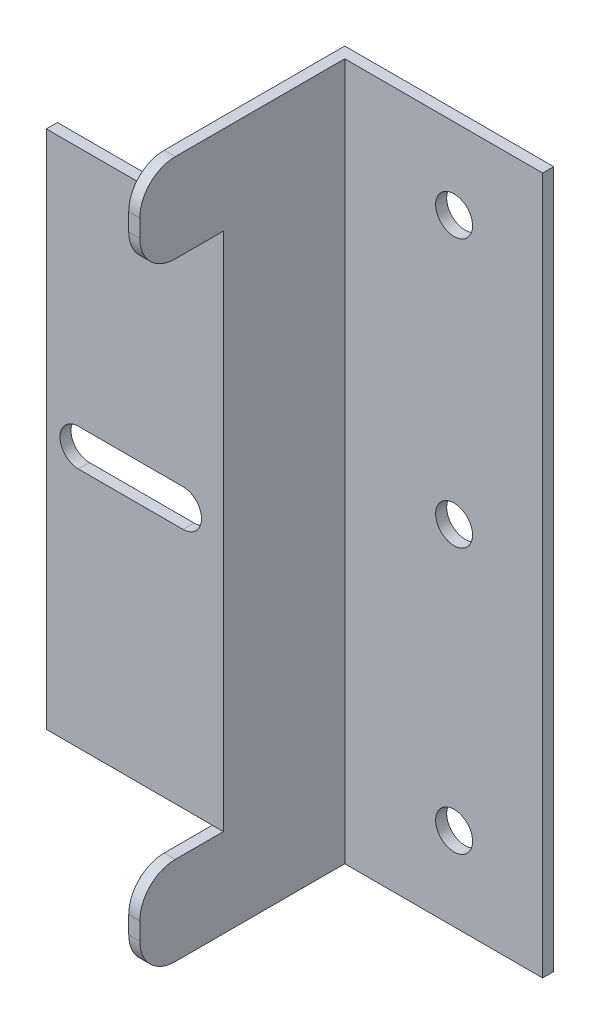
ISO-10303-21;
HEADER;
FILE_DESCRIPTION(('STEP AP214'),'2;1');
FILE_NAME('part.step','',(''),(''),'','','');
FILE_SCHEMA(('AUTOMOTIVE_DESIGN { 1 0 10303 214 1 1 1 1 }'));
ENDSEC;
DATA;
#1=APPLICATION_CONTEXT('core data for automotive mechanical design processes');
#2=APPLICATION_PROTOCOL_DEFINITION('international standard','automotive_design',2000,#1);
#3=PRODUCT_CONTEXT('',#1,'mechanical');
#4=PRODUCT('Part','Part','',(#3));
#5=PRODUCT_RELATED_PRODUCT_CATEGORY('part','',(#4));
#6=PRODUCT_DEFINITION_FORMATION('','',#4);
#7=PRODUCT_DEFINITION_CONTEXT('part definition',#1,'design');
#8=PRODUCT_DEFINITION('design','',#6,#7);
#9=PRODUCT_DEFINITION_SHAPE('','',#8);
#10=(LENGTH_UNIT() NAMED_UNIT(*) SI_UNIT(.MILLI.,.METRE.));
#11=(NAMED_UNIT(*) PLANE_ANGLE_UNIT() SI_UNIT($,.RADIAN.));
#12=(NAMED_UNIT(*) SI_UNIT($,.STERADIAN.) SOLID_ANGLE_UNIT());
#13=UNCERTAINTY_MEASURE_WITH_UNIT(LENGTH_MEASURE(1.E-05),#10,'distance_accuracy_value','');
#14=(GEOMETRIC_REPRESENTATION_CONTEXT(3) GLOBAL_UNCERTAINTY_ASSIGNED_CONTEXT((#13)) GLOBAL_UNIT_ASSIGNED_CONTEXT((#10,
#11,#12)) REPRESENTATION_CONTEXT('',''));
#15=CARTESIAN_POINT('',(0.,0.,0.));
#16=DIRECTION('',(0.,0.,1.));
#17=DIRECTION('',(1.,0.,0.));
#18=AXIS2_PLACEMENT_3D('',#15,#16,#17);
#19=CARTESIAN_POINT('',(1.5875,49.9999,18.9992));
#20=DIRECTION('',(0.,0.,-1.));
#21=DIRECTION('',(-1.,0.,0.));
#22=AXIS2_PLACEMENT_3D('',#19,#20,#21);
#23=PLANE('',#22);
#24=DIRECTION('',(-1.,0.,0.));
#25=VECTOR('',#24,1.);
#26=CARTESIAN_POINT('',(1.5875,-2.65,18.9992));
#27=LINE('',#26,#25);
#28=CARTESIAN_POINT('',(-4.19771789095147,-2.65,18.9992));
#29=VERTEX_POINT('',#28);
#30=CARTESIAN_POINT('',(-19.2018800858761,-2.65,18.9992));
#31=VERTEX_POINT('',#30);
#32=EDGE_CURVE('E189',#29,#31,#27,.T.);
#33=ORIENTED_EDGE('',*,*,#32,.T.);
#34=CARTESIAN_POINT('',(-19.2018800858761,0.,18.9992));
#35=DIRECTION('',(0.,0.,-1.));
#36=DIRECTION('',(-1.,0.,0.));
#37=AXIS2_PLACEMENT_3D('',#34,#35,#36);
#38=CIRCLE('',#37,2.65);
#39=CARTESIAN_POINT('',(-19.2018800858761,2.65,18.9992));
#40=VERTEX_POINT('',#39);
#41=EDGE_CURVE('E211',#31,#40,#38,.T.);
#42=ORIENTED_EDGE('',*,*,#41,.T.);
#43=DIRECTION('',(1.,0.,0.));
#44=VECTOR('',#43,1.);
#45=CARTESIAN_POINT('',(1.5875,2.65,18.9992));
#46=LINE('',#45,#44);
#47=CARTESIAN_POINT('',(-4.19771789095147,2.65,18.9992));
#48=VERTEX_POINT('',#47);
#49=EDGE_CURVE('E210',#40,#48,#46,.T.);
#50=ORIENTED_EDGE('',*,*,#49,.T.);
#51=CARTESIAN_POINT('',(-4.19771789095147,0.,18.9992));
#52=DIRECTION('',(0.,0.,-1.));
#53=DIRECTION('',(-1.,0.,0.));
#54=AXIS2_PLACEMENT_3D('',#51,#52,#53);
#55=CIRCLE('',#54,2.65);
#56=EDGE_CURVE('E191',#48,#29,#55,.T.);
#57=ORIENTED_EDGE('',*,*,#56,.T.);
#58=EDGE_LOOP('',(#33,#42,#50,#57));
#59=FACE_BOUND('',#58,.T.);
#60=DIRECTION('',(1.,0.,0.));
#61=VECTOR('',#60,1.);
#62=CARTESIAN_POINT('',(0.,37.2999,18.9992));
#63=LINE('',#62,#61);
#64=CARTESIAN_POINT('',(0.,37.2999,18.9992));
#65=VERTEX_POINT('',#64);
#66=CARTESIAN_POINT('',(1.5875,37.2999,18.9992));
#67=VERTEX_POINT('',#66);
#68=EDGE_CURVE('E308',#65,#67,#63,.T.);
#69=ORIENTED_EDGE('',*,*,#68,.F.);
#70=DIRECTION('',(-1.,0.,0.));
#71=VECTOR('',#70,1.);
#72=CARTESIAN_POINT('',(12.7988341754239,37.2999,18.9992));
#73=LINE('',#72,#71);
#74=CARTESIAN_POINT('',(-23.8125,37.2999,18.9992));
#75=VERTEX_POINT('',#74);
#76=EDGE_CURVE('E229',#65,#75,#73,.T.);
#77=ORIENTED_EDGE('',*,*,#76,.T.);
#78=DIRECTION('',(0.,-1.,0.));
#79=VECTOR('',#78,1.);
#80=CARTESIAN_POINT('',(-23.8125,49.9999,18.9992));
#81=LINE('',#80,#79);
#82=CARTESIAN_POINT('',(-23.8125,-37.2999,18.9992));
#83=VERTEX_POINT('',#82);
#84=EDGE_CURVE('E384',#75,#83,#81,.T.);
#85=ORIENTED_EDGE('',*,*,#84,.T.);
#86=DIRECTION('',(-1.,0.,0.));
#87=VECTOR('',#86,1.);
#88=CARTESIAN_POINT('',(12.7988341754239,-37.2999,18.9992));
#89=LINE('',#88,#87);
#90=CARTESIAN_POINT('',(0.,-37.2999,18.9992));
#91=VERTEX_POINT('',#90);
#92=EDGE_CURVE('E235',#91,#83,#89,.T.);
#93=ORIENTED_EDGE('',*,*,#92,.F.);
#94=DIRECTION('',(1.,0.,0.));
#95=VECTOR('',#94,1.);
#96=CARTESIAN_POINT('',(0.,-37.2999,18.9992));
#97=LINE('',#96,#95);
#98=CARTESIAN_POINT('',(1.5875,-37.2999,18.9992));
#99=VERTEX_POINT('',#98);
#100=EDGE_CURVE('E265',#91,#99,#97,.T.);
#101=ORIENTED_EDGE('',*,*,#100,.T.);
#102=DIRECTION('',(0.,-1.,0.));
#103=VECTOR('',#102,1.);
#104=CARTESIAN_POINT('',(1.5875,49.9999,18.9992));
#105=LINE('',#104,#103);
#106=EDGE_CURVE('E381',#67,#99,#105,.T.);
#107=ORIENTED_EDGE('',*,*,#106,.F.);
#108=EDGE_LOOP('',(#69,#77,#85,#93,#101,#107));
#109=FACE_BOUND('',#108,.T.);
#110=ADVANCED_FACE('F44',(#59,#109),#23,.F.);
#111=CARTESIAN_POINT('',(29.972,49.9999,1.5875));
#112=DIRECTION('',(-1.,0.,0.));
#113=DIRECTION('',(0.,0.,1.));
#114=AXIS2_PLACEMENT_3D('',#111,#112,#113);
#115=PLANE('',#114);
#116=DIRECTION('',(0.,0.,-1.));
#117=VECTOR('',#116,1.);
#118=CARTESIAN_POINT('',(29.972,-49.9999,1.5875));
#119=LINE('',#118,#117);
#120=CARTESIAN_POINT('',(29.972,-49.9999,1.5875));
#121=VERTEX_POINT('',#120);
#122=CARTESIAN_POINT('',(29.972,-49.9999,0.));
#123=VERTEX_POINT('',#122);
#124=EDGE_CURVE('E285',#121,#123,#119,.T.);
#125=ORIENTED_EDGE('',*,*,#124,.T.);
#126=DIRECTION('',(0.,-1.,0.));
#127=VECTOR('',#126,1.);
#128=CARTESIAN_POINT('',(29.972,49.9999,0.));
#129=LINE('',#128,#127);
#130=CARTESIAN_POINT('',(29.972,49.9999,0.));
#131=VERTEX_POINT('',#130);
#132=EDGE_CURVE('E402',#131,#123,#129,.T.);
#133=ORIENTED_EDGE('',*,*,#132,.F.);
#134=DIRECTION('',(0.,0.,-1.));
#135=VECTOR('',#134,1.);
#136=CARTESIAN_POINT('',(29.972,49.9999,1.5875));
#137=LINE('',#136,#135);
#138=CARTESIAN_POINT('',(29.972,49.9999,1.5875));
#139=VERTEX_POINT('',#138);
#140=EDGE_CURVE('E341',#139,#131,#137,.T.);
#141=ORIENTED_EDGE('',*,*,#140,.F.);
#142=DIRECTION('',(0.,-1.,0.));
#143=VECTOR('',#142,1.);
#144=CARTESIAN_POINT('',(29.972,49.9999,1.5875));
#145=LINE('',#144,#143);
#146=EDGE_CURVE('E358',#139,#121,#145,.T.);
#147=ORIENTED_EDGE('',*,*,#146,.T.);
#148=EDGE_LOOP('',(#125,#133,#141,#147));
#149=FACE_BOUND('',#148,.T.);
#150=ADVANCED_FACE('F50',(#149),#115,.F.);
#151=CARTESIAN_POINT('',(29.972,49.9999,0.));
#152=DIRECTION('',(0.,0.,1.));
#153=DIRECTION('',(1.,0.,0.));
#154=AXIS2_PLACEMENT_3D('',#151,#152,#153);
#155=PLANE('',#154);
#156=CARTESIAN_POINT('',(17.272,0.,0.));
#157=DIRECTION('',(0.,0.,1.));
#158=DIRECTION('',(1.,0.,0.));
#159=AXIS2_PLACEMENT_3D('',#156,#157,#158);
#160=CIRCLE('',#159,2.65);
#161=CARTESIAN_POINT('',(19.922,0.,0.));
#162=VERTEX_POINT('',#161);
#163=EDGE_CURVE('E437',#162,#162,#160,.T.);
#164=ORIENTED_EDGE('',*,*,#163,.T.);
#165=EDGE_LOOP('',(#164));
#166=FACE_BOUND('',#165,.T.);
#167=CARTESIAN_POINT('',(17.272,38.408858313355,0.));
#168=DIRECTION('',(0.,0.,1.));
#169=DIRECTION('',(1.,0.,0.));
#170=AXIS2_PLACEMENT_3D('',#167,#168,#169);
#171=CIRCLE('',#170,2.65);
#172=CARTESIAN_POINT('',(19.922,38.408858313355,0.));
#173=VERTEX_POINT('',#172);
#174=EDGE_CURVE('E445',#173,#173,#171,.T.);
#175=ORIENTED_EDGE('',*,*,#174,.T.);
#176=EDGE_LOOP('',(#175));
#177=FACE_BOUND('',#176,.T.);
#178=CARTESIAN_POINT('',(17.272,-38.0494771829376,0.));
#179=DIRECTION('',(0.,0.,1.));
#180=DIRECTION('',(1.,0.,0.));
#181=AXIS2_PLACEMENT_3D('',#178,#179,#180);
#182=CIRCLE('',#181,2.65);
#183=CARTESIAN_POINT('',(19.922,-38.0494771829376,0.));
#184=VERTEX_POINT('',#183);
#185=EDGE_CURVE('E440',#184,#184,#182,.T.);
#186=ORIENTED_EDGE('',*,*,#185,.T.);
#187=EDGE_LOOP('',(#186));
#188=FACE_BOUND('',#187,.T.);
#189=DIRECTION('',(-1.,0.,0.));
#190=VECTOR('',#189,1.);
#191=CARTESIAN_POINT('',(29.972,-49.9999,0.));
#192=LINE('',#191,#190);
#193=CARTESIAN_POINT('',(0.,-49.9999,0.));
#194=VERTEX_POINT('',#193);
#195=EDGE_CURVE('E361',#123,#194,#192,.T.);
#196=ORIENTED_EDGE('',*,*,#195,.T.);
#197=DIRECTION('',(0.,-1.,0.));
#198=VECTOR('',#197,1.);
#199=CARTESIAN_POINT('',(0.,49.9999,0.));
#200=LINE('',#199,#198);
#201=CARTESIAN_POINT('',(0.,49.9999,0.));
#202=VERTEX_POINT('',#201);
#203=EDGE_CURVE('E396',#202,#194,#200,.T.);
#204=ORIENTED_EDGE('',*,*,#203,.F.);
#205=DIRECTION('',(-1.,0.,0.));
#206=VECTOR('',#205,1.);
#207=CARTESIAN_POINT('',(29.972,49.9999,0.));
#208=LINE('',#207,#206);
#209=EDGE_CURVE('E347',#131,#202,#208,.T.);
#210=ORIENTED_EDGE('',*,*,#209,.F.);
#211=ORIENTED_EDGE('',*,*,#132,.T.);
#212=EDGE_LOOP('',(#196,#204,#210,#211));
#213=FACE_BOUND('',#212,.T.);
#214=ADVANCED_FACE('F448',(#166,#177,#188,#213),#155,.F.);
#215=CARTESIAN_POINT('',(0.,49.9999,0.));
#216=DIRECTION('',(1.,0.,0.));
#217=DIRECTION('',(0.,0.,-1.));
#218=AXIS2_PLACEMENT_3D('',#215,#216,#217);
#219=PLANE('',#218);
#220=DIRECTION('',(0.,0.,1.));
#221=VECTOR('',#220,1.);
#222=CARTESIAN_POINT('',(0.,-49.9999,0.));
#223=LINE('',#222,#221);
#224=CARTESIAN_POINT('',(0.,-49.9999,25.908));
#225=VERTEX_POINT('',#224);
#226=EDGE_CURVE('E368',#194,#225,#223,.T.);
#227=ORIENTED_EDGE('',*,*,#226,.T.);
#228=CARTESIAN_POINT('',(0.,-44.9199,25.908));
#229=DIRECTION('',(1.,0.,0.));
#230=DIRECTION('',(0.,0.,1.));
#231=AXIS2_PLACEMENT_3D('',#228,#229,#230);
#232=CIRCLE('',#231,5.08);
#233=CARTESIAN_POINT('',(0.,-44.9199,30.988));
#234=VERTEX_POINT('',#233);
#235=EDGE_CURVE('E256',#234,#225,#232,.T.);
#236=ORIENTED_EDGE('',*,*,#235,.F.);
#237=DIRECTION('',(0.,-1.,0.));
#238=VECTOR('',#237,1.);
#239=CARTESIAN_POINT('',(0.,-44.9199,30.988));
#240=LINE('',#239,#238);
#241=CARTESIAN_POINT('',(0.,-42.3799,30.988));
#242=VERTEX_POINT('',#241);
#243=EDGE_CURVE('E255',#242,#234,#240,.T.);
#244=ORIENTED_EDGE('',*,*,#243,.F.);
#245=CARTESIAN_POINT('',(0.,-42.3799,25.908));
#246=DIRECTION('',(1.,0.,0.));
#247=DIRECTION('',(0.,0.,1.));
#248=AXIS2_PLACEMENT_3D('',#245,#246,#247);
#249=CIRCLE('',#248,5.08);
#250=CARTESIAN_POINT('',(0.,-37.2999,25.908));
#251=VERTEX_POINT('',#250);
#252=EDGE_CURVE('E248',#251,#242,#249,.T.);
#253=ORIENTED_EDGE('',*,*,#252,.F.);
#254=DIRECTION('',(0.,0.,1.));
#255=VECTOR('',#254,1.);
#256=CARTESIAN_POINT('',(0.,-37.2999,25.908));
#257=LINE('',#256,#255);
#258=EDGE_CURVE('E242',#91,#251,#257,.T.);
#259=ORIENTED_EDGE('',*,*,#258,.F.);
#260=DIRECTION('',(0.,0.,-1.));
#261=VECTOR('',#260,1.);
#262=CARTESIAN_POINT('',(0.,-37.2999,17.4117));
#263=LINE('',#262,#261);
#264=CARTESIAN_POINT('',(0.,-37.2999,17.4117));
#265=VERTEX_POINT('',#264);
#266=EDGE_CURVE('E237',#91,#265,#263,.T.);
#267=ORIENTED_EDGE('',*,*,#266,.T.);
#268=DIRECTION('',(0.,-1.,0.));
#269=VECTOR('',#268,1.);
#270=CARTESIAN_POINT('',(0.,49.9999,17.4117));
#271=LINE('',#270,#269);
#272=CARTESIAN_POINT('',(0.,37.2999,17.4117));
#273=VERTEX_POINT('',#272);
#274=EDGE_CURVE('E395',#273,#265,#271,.T.);
#275=ORIENTED_EDGE('',*,*,#274,.F.);
#276=DIRECTION('',(0.,0.,1.));
#277=VECTOR('',#276,1.);
#278=CARTESIAN_POINT('',(0.,37.2999,17.4117));
#279=LINE('',#278,#277);
#280=EDGE_CURVE('E224',#273,#65,#279,.T.);
#281=ORIENTED_EDGE('',*,*,#280,.T.);
#282=DIRECTION('',(0.,0.,-1.));
#283=VECTOR('',#282,1.);
#284=CARTESIAN_POINT('',(0.,37.2999,25.908));
#285=LINE('',#284,#283);
#286=CARTESIAN_POINT('',(0.,37.2999,25.908));
#287=VERTEX_POINT('',#286);
#288=EDGE_CURVE('E298',#287,#65,#285,.T.);
#289=ORIENTED_EDGE('',*,*,#288,.F.);
#290=CARTESIAN_POINT('',(0.,42.3799,25.908));
#291=DIRECTION('',(1.,0.,0.));
#292=DIRECTION('',(0.,0.,-1.));
#293=AXIS2_PLACEMENT_3D('',#290,#291,#292);
#294=CIRCLE('',#293,5.08);
#295=CARTESIAN_POINT('',(0.,42.3799,30.988));
#296=VERTEX_POINT('',#295);
#297=EDGE_CURVE('E332',#296,#287,#294,.T.);
#298=ORIENTED_EDGE('',*,*,#297,.F.);
#299=DIRECTION('',(0.,-1.,0.));
#300=VECTOR('',#299,1.);
#301=CARTESIAN_POINT('',(0.,44.9199,30.988));
#302=LINE('',#301,#300);
#303=CARTESIAN_POINT('',(0.,44.9199,30.988));
#304=VERTEX_POINT('',#303);
#305=EDGE_CURVE('E333',#304,#296,#302,.T.);
#306=ORIENTED_EDGE('',*,*,#305,.F.);
#307=CARTESIAN_POINT('',(0.,44.9199,25.908));
#308=DIRECTION('',(1.,0.,0.));
#309=DIRECTION('',(0.,0.,-1.));
#310=AXIS2_PLACEMENT_3D('',#307,#308,#309);
#311=CIRCLE('',#310,5.08);
#312=CARTESIAN_POINT('',(0.,49.9999,25.908));
#313=VERTEX_POINT('',#312);
#314=EDGE_CURVE('E320',#313,#304,#311,.T.);
#315=ORIENTED_EDGE('',*,*,#314,.F.);
#316=DIRECTION('',(0.,0.,1.));
#317=VECTOR('',#316,1.);
#318=CARTESIAN_POINT('',(0.,49.9999,0.));
#319=LINE('',#318,#317);
#320=EDGE_CURVE('E348',#202,#313,#319,.T.);
#321=ORIENTED_EDGE('',*,*,#320,.F.);
#322=ORIENTED_EDGE('',*,*,#203,.T.);
#323=EDGE_LOOP('',(#227,#236,#244,#253,#259,#267,#275,#281,#289,#298,#306,#315,#321,#322));
#324=FACE_BOUND('',#323,.T.);
#325=ADVANCED_FACE('F493',(#324),#219,.F.);
#326=CARTESIAN_POINT('',(0.,49.9999,17.4117));
#327=DIRECTION('',(0.,0.,1.));
#328=DIRECTION('',(1.,0.,0.));
#329=AXIS2_PLACEMENT_3D('',#326,#327,#328);
#330=PLANE('',#329);
#331=DIRECTION('',(-1.,0.,0.));
#332=VECTOR('',#331,1.);
#333=CARTESIAN_POINT('',(0.,2.65,17.4117));
#334=LINE('',#333,#332);
#335=CARTESIAN_POINT('',(-4.19771789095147,2.65,17.4117));
#336=VERTEX_POINT('',#335);
#337=CARTESIAN_POINT('',(-19.2018800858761,2.65,17.4117));
#338=VERTEX_POINT('',#337);
#339=EDGE_CURVE('E53',#336,#338,#334,.T.);
#340=ORIENTED_EDGE('',*,*,#339,.T.);
#341=CARTESIAN_POINT('',(-19.2018800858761,0.,17.4117));
#342=DIRECTION('',(0.,0.,1.));
#343=DIRECTION('',(1.,0.,0.));
#344=AXIS2_PLACEMENT_3D('',#341,#342,#343);
#345=CIRCLE('',#344,2.65);
#346=CARTESIAN_POINT('',(-19.2018800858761,-2.65,17.4117));
#347=VERTEX_POINT('',#346);
#348=EDGE_CURVE('E11',#338,#347,#345,.T.);
#349=ORIENTED_EDGE('',*,*,#348,.T.);
#350=DIRECTION('',(1.,0.,0.));
#351=VECTOR('',#350,1.);
#352=CARTESIAN_POINT('',(0.,-2.65,17.4117));
#353=LINE('',#352,#351);
#354=CARTESIAN_POINT('',(-4.19771789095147,-2.65,17.4117));
#355=VERTEX_POINT('',#354);
#356=EDGE_CURVE('E403',#347,#355,#353,.T.);
#357=ORIENTED_EDGE('',*,*,#356,.T.);
#358=CARTESIAN_POINT('',(-4.19771789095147,0.,17.4117));
#359=DIRECTION('',(0.,0.,1.));
#360=DIRECTION('',(1.,0.,0.));
#361=AXIS2_PLACEMENT_3D('',#358,#359,#360);
#362=CIRCLE('',#361,2.65);
#363=EDGE_CURVE('E199',#355,#336,#362,.T.);
#364=ORIENTED_EDGE('',*,*,#363,.T.);
#365=EDGE_LOOP('',(#340,#349,#357,#364));
#366=FACE_BOUND('',#365,.T.);
#367=DIRECTION('',(0.,-1.,0.));
#368=VECTOR('',#367,1.);
#369=CARTESIAN_POINT('',(-23.8125,49.9999,17.4117));
#370=LINE('',#369,#368);
#371=CARTESIAN_POINT('',(-23.8125,37.2999,17.4117));
#372=VERTEX_POINT('',#371);
#373=CARTESIAN_POINT('',(-23.8125,-37.2999,17.4117));
#374=VERTEX_POINT('',#373);
#375=EDGE_CURVE('E386',#372,#374,#370,.T.);
#376=ORIENTED_EDGE('',*,*,#375,.F.);
#377=DIRECTION('',(-1.,0.,0.));
#378=VECTOR('',#377,1.);
#379=CARTESIAN_POINT('',(12.7988341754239,37.2999,17.4117));
#380=LINE('',#379,#378);
#381=EDGE_CURVE('E222',#273,#372,#380,.T.);
#382=ORIENTED_EDGE('',*,*,#381,.F.);
#383=ORIENTED_EDGE('',*,*,#274,.T.);
#384=DIRECTION('',(-1.,0.,0.));
#385=VECTOR('',#384,1.);
#386=CARTESIAN_POINT('',(12.7988341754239,-37.2999,17.4117));
#387=LINE('',#386,#385);
#388=EDGE_CURVE('E220',#265,#374,#387,.T.);
#389=ORIENTED_EDGE('',*,*,#388,.T.);
#390=EDGE_LOOP('',(#376,#382,#383,#389));
#391=FACE_BOUND('',#390,.T.);
#392=ADVANCED_FACE('F424',(#366,#391),#330,.F.);
#393=CARTESIAN_POINT('',(-23.8125,49.9999,18.9992));
#394=DIRECTION('',(1.,0.,0.));
#395=DIRECTION('',(0.,0.,-1.));
#396=AXIS2_PLACEMENT_3D('',#393,#394,#395);
#397=PLANE('',#396);
#398=ORIENTED_EDGE('',*,*,#84,.F.);
#399=DIRECTION('',(0.,0.,1.));
#400=VECTOR('',#399,1.);
#401=CARTESIAN_POINT('',(-23.8125,37.2999,17.4117));
#402=LINE('',#401,#400);
#403=EDGE_CURVE('E217',#372,#75,#402,.T.);
#404=ORIENTED_EDGE('',*,*,#403,.F.);
#405=ORIENTED_EDGE('',*,*,#375,.T.);
#406=DIRECTION('',(0.,0.,-1.));
#407=VECTOR('',#406,1.);
#408=CARTESIAN_POINT('',(-23.8125,-37.2999,17.4117));
#409=LINE('',#408,#407);
#410=EDGE_CURVE('E225',#83,#374,#409,.T.);
#411=ORIENTED_EDGE('',*,*,#410,.F.);
#412=EDGE_LOOP('',(#398,#404,#405,#411));
#413=FACE_BOUND('',#412,.T.);
#414=ADVANCED_FACE('F517',(#413),#397,.F.);
#415=CARTESIAN_POINT('',(1.5875,49.9999,1.5875));
#416=DIRECTION('',(-1.,0.,0.));
#417=DIRECTION('',(0.,0.,1.));
#418=AXIS2_PLACEMENT_3D('',#415,#416,#417);
#419=PLANE('',#418);
#420=DIRECTION('',(0.,0.,-1.));
#421=VECTOR('',#420,1.);
#422=CARTESIAN_POINT('',(1.5875,-49.9999,1.5875));
#423=LINE('',#422,#421);
#424=CARTESIAN_POINT('',(1.5875,-49.9999,25.908));
#425=VERTEX_POINT('',#424);
#426=CARTESIAN_POINT('',(1.5875,-49.9999,1.5875));
#427=VERTEX_POINT('',#426);
#428=EDGE_CURVE('E369',#425,#427,#423,.T.);
#429=ORIENTED_EDGE('',*,*,#428,.T.);
#430=DIRECTION('',(0.,-1.,0.));
#431=VECTOR('',#430,1.);
#432=CARTESIAN_POINT('',(1.5875,49.9999,1.5875));
#433=LINE('',#432,#431);
#434=CARTESIAN_POINT('',(1.5875,49.9999,1.5875));
#435=VERTEX_POINT('',#434);
#436=EDGE_CURVE('E380',#435,#427,#433,.T.);
#437=ORIENTED_EDGE('',*,*,#436,.F.);
#438=DIRECTION('',(0.,0.,-1.));
#439=VECTOR('',#438,1.);
#440=CARTESIAN_POINT('',(1.5875,49.9999,1.5875));
#441=LINE('',#440,#439);
#442=CARTESIAN_POINT('',(1.5875,49.9999,25.908));
#443=VERTEX_POINT('',#442);
#444=EDGE_CURVE('E355',#443,#435,#441,.T.);
#445=ORIENTED_EDGE('',*,*,#444,.F.);
#446=CARTESIAN_POINT('',(1.5875,44.9199,25.908));
#447=DIRECTION('',(1.,0.,0.));
#448=DIRECTION('',(0.,0.,-1.));
#449=AXIS2_PLACEMENT_3D('',#446,#447,#448);
#450=CIRCLE('',#449,5.08);
#451=CARTESIAN_POINT('',(1.5875,44.9199,30.988));
#452=VERTEX_POINT('',#451);
#453=EDGE_CURVE('E268',#443,#452,#450,.T.);
#454=ORIENTED_EDGE('',*,*,#453,.T.);
#455=DIRECTION('',(0.,-1.,0.));
#456=VECTOR('',#455,1.);
#457=CARTESIAN_POINT('',(1.5875,44.9199,30.988));
#458=LINE('',#457,#456);
#459=CARTESIAN_POINT('',(1.5875,42.3799,30.988));
#460=VERTEX_POINT('',#459);
#461=EDGE_CURVE('E321',#452,#460,#458,.T.);
#462=ORIENTED_EDGE('',*,*,#461,.T.);
#463=CARTESIAN_POINT('',(1.5875,42.3799,25.908));
#464=DIRECTION('',(1.,0.,0.));
#465=DIRECTION('',(0.,0.,-1.));
#466=AXIS2_PLACEMENT_3D('',#463,#464,#465);
#467=CIRCLE('',#466,5.08);
#468=CARTESIAN_POINT('',(1.5875,37.2999,25.908));
#469=VERTEX_POINT('',#468);
#470=EDGE_CURVE('E316',#460,#469,#467,.T.);
#471=ORIENTED_EDGE('',*,*,#470,.T.);
#472=DIRECTION('',(0.,0.,-1.));
#473=VECTOR('',#472,1.);
#474=CARTESIAN_POINT('',(1.5875,37.2999,25.908));
#475=LINE('',#474,#473);
#476=EDGE_CURVE('E315',#469,#67,#475,.T.);
#477=ORIENTED_EDGE('',*,*,#476,.T.);
#478=ORIENTED_EDGE('',*,*,#106,.T.);
#479=DIRECTION('',(0.,0.,1.));
#480=VECTOR('',#479,1.);
#481=CARTESIAN_POINT('',(1.5875,-37.2999,25.908));
#482=LINE('',#481,#480);
#483=CARTESIAN_POINT('',(1.5875,-37.2999,25.908));
#484=VERTEX_POINT('',#483);
#485=EDGE_CURVE('E263',#99,#484,#482,.T.);
#486=ORIENTED_EDGE('',*,*,#485,.T.);
#487=CARTESIAN_POINT('',(1.5875,-42.3799,25.908));
#488=DIRECTION('',(1.,0.,0.));
#489=DIRECTION('',(0.,0.,1.));
#490=AXIS2_PLACEMENT_3D('',#487,#488,#489);
#491=CIRCLE('',#490,5.08);
#492=CARTESIAN_POINT('',(1.5875,-42.3799,30.988));
#493=VERTEX_POINT('',#492);
#494=EDGE_CURVE('E270',#484,#493,#491,.T.);
#495=ORIENTED_EDGE('',*,*,#494,.T.);
#496=DIRECTION('',(0.,-1.,0.));
#497=VECTOR('',#496,1.);
#498=CARTESIAN_POINT('',(1.5875,-44.9199,30.988));
#499=LINE('',#498,#497);
#500=CARTESIAN_POINT('',(1.5875,-44.9199,30.988));
#501=VERTEX_POINT('',#500);
#502=EDGE_CURVE('E275',#493,#501,#499,.T.);
#503=ORIENTED_EDGE('',*,*,#502,.T.);
#504=CARTESIAN_POINT('',(1.5875,-44.9199,25.908));
#505=DIRECTION('',(1.,0.,0.));
#506=DIRECTION('',(0.,0.,1.));
#507=AXIS2_PLACEMENT_3D('',#504,#505,#506);
#508=CIRCLE('',#507,5.08);
#509=EDGE_CURVE('E247',#501,#425,#508,.T.);
#510=ORIENTED_EDGE('',*,*,#509,.T.);
#511=EDGE_LOOP('',(#429,#437,#445,#454,#462,#471,#477,#478,#486,#495,#503,#510));
#512=FACE_BOUND('',#511,.T.);
#513=ADVANCED_FACE('F463',(#512),#419,.F.);
#514=CARTESIAN_POINT('',(29.972,49.9999,1.5875));
#515=DIRECTION('',(0.,0.,-1.));
#516=DIRECTION('',(-1.,0.,0.));
#517=AXIS2_PLACEMENT_3D('',#514,#515,#516);
#518=PLANE('',#517);
#519=CARTESIAN_POINT('',(17.272,0.,1.5875));
#520=DIRECTION('',(0.,0.,-1.));
#521=DIRECTION('',(-1.,0.,0.));
#522=AXIS2_PLACEMENT_3D('',#519,#520,#521);
#523=CIRCLE('',#522,2.65);
#524=CARTESIAN_POINT('',(14.622,0.,1.5875));
#525=VERTEX_POINT('',#524);
#526=EDGE_CURVE('E195',#525,#525,#523,.T.);
#527=ORIENTED_EDGE('',*,*,#526,.T.);
#528=EDGE_LOOP('',(#527));
#529=FACE_BOUND('',#528,.T.);
#530=CARTESIAN_POINT('',(17.272,38.408858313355,1.5875));
#531=DIRECTION('',(0.,0.,-1.));
#532=DIRECTION('',(-1.,0.,0.));
#533=AXIS2_PLACEMENT_3D('',#530,#531,#532);
#534=CIRCLE('',#533,2.65);
#535=CARTESIAN_POINT('',(14.622,38.408858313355,1.5875));
#536=VERTEX_POINT('',#535);
#537=EDGE_CURVE('E407',#536,#536,#534,.T.);
#538=ORIENTED_EDGE('',*,*,#537,.T.);
#539=EDGE_LOOP('',(#538));
#540=FACE_BOUND('',#539,.T.);
#541=CARTESIAN_POINT('',(17.272,-38.0494771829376,1.5875));
#542=DIRECTION('',(0.,0.,-1.));
#543=DIRECTION('',(-1.,0.,0.));
#544=AXIS2_PLACEMENT_3D('',#541,#542,#543);
#545=CIRCLE('',#544,2.65);
#546=CARTESIAN_POINT('',(14.622,-38.0494771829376,1.5875));
#547=VERTEX_POINT('',#546);
#548=EDGE_CURVE('E409',#547,#547,#545,.T.);
#549=ORIENTED_EDGE('',*,*,#548,.T.);
#550=EDGE_LOOP('',(#549));
#551=FACE_BOUND('',#550,.T.);
#552=DIRECTION('',(1.,0.,0.));
#553=VECTOR('',#552,1.);
#554=CARTESIAN_POINT('',(29.972,-49.9999,1.5875));
#555=LINE('',#554,#553);
#556=EDGE_CURVE('E350',#427,#121,#555,.T.);
#557=ORIENTED_EDGE('',*,*,#556,.T.);
#558=ORIENTED_EDGE('',*,*,#146,.F.);
#559=DIRECTION('',(1.,0.,0.));
#560=VECTOR('',#559,1.);
#561=CARTESIAN_POINT('',(29.972,49.9999,1.5875));
#562=LINE('',#561,#560);
#563=EDGE_CURVE('E359',#435,#139,#562,.T.);
#564=ORIENTED_EDGE('',*,*,#563,.F.);
#565=ORIENTED_EDGE('',*,*,#436,.T.);
#566=EDGE_LOOP('',(#557,#558,#564,#565));
#567=FACE_BOUND('',#566,.T.);
#568=ADVANCED_FACE('F458',(#529,#540,#551,#567),#518,.F.);
#569=CARTESIAN_POINT('',(0.,49.9999,0.));
#570=DIRECTION('',(0.,1.,0.));
#571=DIRECTION('',(0.,0.,1.));
#572=AXIS2_PLACEMENT_3D('',#569,#570,#571);
#573=PLANE('',#572);
#574=ORIENTED_EDGE('',*,*,#320,.T.);
#575=DIRECTION('',(1.,0.,0.));
#576=VECTOR('',#575,1.);
#577=CARTESIAN_POINT('',(0.,49.9999,25.908));
#578=LINE('',#577,#576);
#579=EDGE_CURVE('E227',#313,#443,#578,.T.);
#580=ORIENTED_EDGE('',*,*,#579,.T.);
#581=ORIENTED_EDGE('',*,*,#444,.T.);
#582=ORIENTED_EDGE('',*,*,#563,.T.);
#583=ORIENTED_EDGE('',*,*,#140,.T.);
#584=ORIENTED_EDGE('',*,*,#209,.T.);
#585=EDGE_LOOP('',(#574,#580,#581,#582,#583,#584));
#586=FACE_BOUND('',#585,.T.);
#587=ADVANCED_FACE('F465',(#586),#573,.T.);
#588=CARTESIAN_POINT('',(0.,-49.9999,0.));
#589=DIRECTION('',(0.,1.,0.));
#590=DIRECTION('',(0.,0.,1.));
#591=AXIS2_PLACEMENT_3D('',#588,#589,#590);
#592=PLANE('',#591);
#593=DIRECTION('',(1.,0.,0.));
#594=VECTOR('',#593,1.);
#595=CARTESIAN_POINT('',(0.,-49.9999,25.908));
#596=LINE('',#595,#594);
#597=EDGE_CURVE('E276',#225,#425,#596,.T.);
#598=ORIENTED_EDGE('',*,*,#597,.F.);
#599=ORIENTED_EDGE('',*,*,#226,.F.);
#600=ORIENTED_EDGE('',*,*,#195,.F.);
#601=ORIENTED_EDGE('',*,*,#124,.F.);
#602=ORIENTED_EDGE('',*,*,#556,.F.);
#603=ORIENTED_EDGE('',*,*,#428,.F.);
#604=EDGE_LOOP('',(#598,#599,#600,#601,#602,#603));
#605=FACE_BOUND('',#604,.T.);
#606=ADVANCED_FACE('F479',(#605),#592,.F.);
#607=CARTESIAN_POINT('',(0.,44.9199,25.908));
#608=DIRECTION('',(1.,0.,0.));
#609=DIRECTION('',(0.,0.,-1.));
#610=AXIS2_PLACEMENT_3D('',#607,#608,#609);
#611=CYLINDRICAL_SURFACE('',#610,5.08);
#612=ORIENTED_EDGE('',*,*,#453,.F.);
#613=ORIENTED_EDGE('',*,*,#579,.F.);
#614=ORIENTED_EDGE('',*,*,#314,.T.);
#615=DIRECTION('',(1.,0.,0.));
#616=VECTOR('',#615,1.);
#617=CARTESIAN_POINT('',(0.,44.9199,30.988));
#618=LINE('',#617,#616);
#619=EDGE_CURVE('E299',#304,#452,#618,.T.);
#620=ORIENTED_EDGE('',*,*,#619,.T.);
#621=EDGE_LOOP('',(#612,#613,#614,#620));
#622=FACE_BOUND('',#621,.T.);
#623=ADVANCED_FACE('F674',(#622),#611,.T.);
#624=CARTESIAN_POINT('',(0.,37.2999,25.908));
#625=DIRECTION('',(0.,-1.,0.));
#626=DIRECTION('',(0.,0.,-1.));
#627=AXIS2_PLACEMENT_3D('',#624,#625,#626);
#628=PLANE('',#627);
#629=ORIENTED_EDGE('',*,*,#476,.F.);
#630=DIRECTION('',(1.,0.,0.));
#631=VECTOR('',#630,1.);
#632=CARTESIAN_POINT('',(0.,37.2999,25.908));
#633=LINE('',#632,#631);
#634=EDGE_CURVE('E305',#287,#469,#633,.T.);
#635=ORIENTED_EDGE('',*,*,#634,.F.);
#636=ORIENTED_EDGE('',*,*,#288,.T.);
#637=ORIENTED_EDGE('',*,*,#68,.T.);
#638=EDGE_LOOP('',(#629,#635,#636,#637));
#639=FACE_BOUND('',#638,.T.);
#640=ADVANCED_FACE('F515',(#639),#628,.T.);
#641=CARTESIAN_POINT('',(0.,42.3799,25.908));
#642=DIRECTION('',(1.,0.,0.));
#643=DIRECTION('',(0.,0.,-1.));
#644=AXIS2_PLACEMENT_3D('',#641,#642,#643);
#645=CYLINDRICAL_SURFACE('',#644,5.08);
#646=ORIENTED_EDGE('',*,*,#470,.F.);
#647=DIRECTION('',(1.,0.,0.));
#648=VECTOR('',#647,1.);
#649=CARTESIAN_POINT('',(0.,42.3799,30.988));
#650=LINE('',#649,#648);
#651=EDGE_CURVE('E297',#296,#460,#650,.T.);
#652=ORIENTED_EDGE('',*,*,#651,.F.);
#653=ORIENTED_EDGE('',*,*,#297,.T.);
#654=ORIENTED_EDGE('',*,*,#634,.T.);
#655=EDGE_LOOP('',(#646,#652,#653,#654));
#656=FACE_BOUND('',#655,.T.);
#657=ADVANCED_FACE('F652',(#656),#645,.T.);
#658=CARTESIAN_POINT('',(0.,44.9199,30.988));
#659=DIRECTION('',(0.,0.,1.));
#660=DIRECTION('',(1.,0.,0.));
#661=AXIS2_PLACEMENT_3D('',#658,#659,#660);
#662=PLANE('',#661);
#663=ORIENTED_EDGE('',*,*,#461,.F.);
#664=ORIENTED_EDGE('',*,*,#619,.F.);
#665=ORIENTED_EDGE('',*,*,#305,.T.);
#666=ORIENTED_EDGE('',*,*,#651,.T.);
#667=EDGE_LOOP('',(#663,#664,#665,#666));
#668=FACE_BOUND('',#667,.T.);
#669=ADVANCED_FACE('F646',(#668),#662,.T.);
#670=CARTESIAN_POINT('',(0.,-44.9199,25.908));
#671=DIRECTION('',(1.,0.,0.));
#672=DIRECTION('',(0.,0.,-1.));
#673=AXIS2_PLACEMENT_3D('',#670,#671,#672);
#674=CYLINDRICAL_SURFACE('',#673,5.08);
#675=ORIENTED_EDGE('',*,*,#509,.F.);
#676=DIRECTION('',(1.,0.,0.));
#677=VECTOR('',#676,1.);
#678=CARTESIAN_POINT('',(0.,-44.9199,30.988));
#679=LINE('',#678,#677);
#680=EDGE_CURVE('E283',#234,#501,#679,.T.);
#681=ORIENTED_EDGE('',*,*,#680,.F.);
#682=ORIENTED_EDGE('',*,*,#235,.T.);
#683=ORIENTED_EDGE('',*,*,#597,.T.);
#684=EDGE_LOOP('',(#675,#681,#682,#683));
#685=FACE_BOUND('',#684,.T.);
#686=ADVANCED_FACE('F489',(#685),#674,.T.);
#687=CARTESIAN_POINT('',(0.,-44.9199,30.988));
#688=DIRECTION('',(0.,0.,1.));
#689=DIRECTION('',(1.,0.,0.));
#690=AXIS2_PLACEMENT_3D('',#687,#688,#689);
#691=PLANE('',#690);
#692=ORIENTED_EDGE('',*,*,#502,.F.);
#693=DIRECTION('',(1.,0.,0.));
#694=VECTOR('',#693,1.);
#695=CARTESIAN_POINT('',(0.,-42.3799,30.988));
#696=LINE('',#695,#694);
#697=EDGE_CURVE('E286',#242,#493,#696,.T.);
#698=ORIENTED_EDGE('',*,*,#697,.F.);
#699=ORIENTED_EDGE('',*,*,#243,.T.);
#700=ORIENTED_EDGE('',*,*,#680,.T.);
#701=EDGE_LOOP('',(#692,#698,#699,#700));
#702=FACE_BOUND('',#701,.T.);
#703=ADVANCED_FACE('F499',(#702),#691,.T.);
#704=CARTESIAN_POINT('',(0.,-42.3799,25.908));
#705=DIRECTION('',(1.,0.,0.));
#706=DIRECTION('',(0.,0.,-1.));
#707=AXIS2_PLACEMENT_3D('',#704,#705,#706);
#708=CYLINDRICAL_SURFACE('',#707,5.08);
#709=ORIENTED_EDGE('',*,*,#494,.F.);
#710=DIRECTION('',(1.,0.,0.));
#711=VECTOR('',#710,1.);
#712=CARTESIAN_POINT('',(0.,-37.2999,25.908));
#713=LINE('',#712,#711);
#714=EDGE_CURVE('E287',#251,#484,#713,.T.);
#715=ORIENTED_EDGE('',*,*,#714,.F.);
#716=ORIENTED_EDGE('',*,*,#252,.T.);
#717=ORIENTED_EDGE('',*,*,#697,.T.);
#718=EDGE_LOOP('',(#709,#715,#716,#717));
#719=FACE_BOUND('',#718,.T.);
#720=ADVANCED_FACE('F504',(#719),#708,.T.);
#721=CARTESIAN_POINT('',(0.,-37.2999,25.908));
#722=DIRECTION('',(0.,1.,0.));
#723=DIRECTION('',(0.,0.,1.));
#724=AXIS2_PLACEMENT_3D('',#721,#722,#723);
#725=PLANE('',#724);
#726=ORIENTED_EDGE('',*,*,#485,.F.);
#727=ORIENTED_EDGE('',*,*,#100,.F.);
#728=ORIENTED_EDGE('',*,*,#258,.T.);
#729=ORIENTED_EDGE('',*,*,#714,.T.);
#730=EDGE_LOOP('',(#726,#727,#728,#729));
#731=FACE_BOUND('',#730,.T.);
#732=ADVANCED_FACE('F502',(#731),#725,.T.);
#733=CARTESIAN_POINT('',(12.7988341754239,-37.2999,17.4117));
#734=DIRECTION('',(0.,1.,0.));
#735=DIRECTION('',(0.,0.,1.));
#736=AXIS2_PLACEMENT_3D('',#733,#734,#735);
#737=PLANE('',#736);
#738=ORIENTED_EDGE('',*,*,#92,.T.);
#739=ORIENTED_EDGE('',*,*,#410,.T.);
#740=ORIENTED_EDGE('',*,*,#388,.F.);
#741=ORIENTED_EDGE('',*,*,#266,.F.);
#742=EDGE_LOOP('',(#738,#739,#740,#741));
#743=FACE_BOUND('',#742,.T.);
#744=ADVANCED_FACE('F525',(#743),#737,.F.);
#745=CARTESIAN_POINT('',(12.7988341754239,37.2999,17.4117));
#746=DIRECTION('',(0.,-1.,0.));
#747=DIRECTION('',(0.,0.,-1.));
#748=AXIS2_PLACEMENT_3D('',#745,#746,#747);
#749=PLANE('',#748);
#750=ORIENTED_EDGE('',*,*,#381,.T.);
#751=ORIENTED_EDGE('',*,*,#403,.T.);
#752=ORIENTED_EDGE('',*,*,#76,.F.);
#753=ORIENTED_EDGE('',*,*,#280,.F.);
#754=EDGE_LOOP('',(#750,#751,#752,#753));
#755=FACE_BOUND('',#754,.T.);
#756=ADVANCED_FACE('F527',(#755),#749,.F.);
#757=CARTESIAN_POINT('',(17.272,-38.0494771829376,0.));
#758=DIRECTION('',(0.,0.,1.));
#759=DIRECTION('',(1.,0.,0.));
#760=AXIS2_PLACEMENT_3D('',#757,#758,#759);
#761=CYLINDRICAL_SURFACE('',#760,2.65);
#762=ORIENTED_EDGE('',*,*,#185,.F.);
#763=EDGE_LOOP('',(#762));
#764=FACE_BOUND('',#763,.T.);
#765=ORIENTED_EDGE('',*,*,#548,.F.);
#766=EDGE_LOOP('',(#765));
#767=FACE_BOUND('',#766,.T.);
#768=ADVANCED_FACE('F457',(#764,#767),#761,.F.);
#769=CARTESIAN_POINT('',(17.272,38.408858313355,0.));
#770=DIRECTION('',(0.,0.,1.));
#771=DIRECTION('',(1.,0.,0.));
#772=AXIS2_PLACEMENT_3D('',#769,#770,#771);
#773=CYLINDRICAL_SURFACE('',#772,2.65);
#774=ORIENTED_EDGE('',*,*,#174,.F.);
#775=EDGE_LOOP('',(#774));
#776=FACE_BOUND('',#775,.T.);
#777=ORIENTED_EDGE('',*,*,#537,.F.);
#778=EDGE_LOOP('',(#777));
#779=FACE_BOUND('',#778,.T.);
#780=ADVANCED_FACE('F451',(#776,#779),#773,.F.);
#781=CARTESIAN_POINT('',(17.272,0.,0.));
#782=DIRECTION('',(0.,0.,1.));
#783=DIRECTION('',(1.,0.,0.));
#784=AXIS2_PLACEMENT_3D('',#781,#782,#783);
#785=CYLINDRICAL_SURFACE('',#784,2.65);
#786=ORIENTED_EDGE('',*,*,#163,.F.);
#787=EDGE_LOOP('',(#786));
#788=FACE_BOUND('',#787,.T.);
#789=ORIENTED_EDGE('',*,*,#526,.F.);
#790=EDGE_LOOP('',(#789));
#791=FACE_BOUND('',#790,.T.);
#792=ADVANCED_FACE('F452',(#788,#791),#785,.F.);
#793=CARTESIAN_POINT('',(-19.2018800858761,0.,0.));
#794=DIRECTION('',(0.,0.,1.));
#795=DIRECTION('',(1.,0.,0.));
#796=AXIS2_PLACEMENT_3D('',#793,#794,#795);
#797=CYLINDRICAL_SURFACE('',#796,2.65);
#798=DIRECTION('',(0.,0.,1.));
#799=VECTOR('',#798,1.);
#800=CARTESIAN_POINT('',(-19.2018800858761,-2.65,0.));
#801=LINE('',#800,#799);
#802=EDGE_CURVE('E64',#347,#31,#801,.T.);
#803=ORIENTED_EDGE('',*,*,#802,.F.);
#804=ORIENTED_EDGE('',*,*,#348,.F.);
#805=DIRECTION('',(0.,0.,1.));
#806=VECTOR('',#805,1.);
#807=CARTESIAN_POINT('',(-19.2018800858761,2.65,0.));
#808=LINE('',#807,#806);
#809=EDGE_CURVE('E414',#338,#40,#808,.T.);
#810=ORIENTED_EDGE('',*,*,#809,.T.);
#811=ORIENTED_EDGE('',*,*,#41,.F.);
#812=EDGE_LOOP('',(#803,#804,#810,#811));
#813=FACE_BOUND('',#812,.T.);
#814=ADVANCED_FACE('F556',(#813),#797,.F.);
#815=CARTESIAN_POINT('',(-19.2018800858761,2.65,0.));
#816=DIRECTION('',(0.,1.,0.));
#817=DIRECTION('',(0.,0.,1.));
#818=AXIS2_PLACEMENT_3D('',#815,#816,#817);
#819=PLANE('',#818);
#820=ORIENTED_EDGE('',*,*,#809,.F.);
#821=ORIENTED_EDGE('',*,*,#339,.F.);
#822=DIRECTION('',(0.,0.,1.));
#823=VECTOR('',#822,1.);
#824=CARTESIAN_POINT('',(-4.19771789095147,2.65,0.));
#825=LINE('',#824,#823);
#826=EDGE_CURVE('E201',#336,#48,#825,.T.);
#827=ORIENTED_EDGE('',*,*,#826,.T.);
#828=ORIENTED_EDGE('',*,*,#49,.F.);
#829=EDGE_LOOP('',(#820,#821,#827,#828));
#830=FACE_BOUND('',#829,.T.);
#831=ADVANCED_FACE('F428',(#830),#819,.F.);
#832=CARTESIAN_POINT('',(-4.19771789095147,0.,0.));
#833=DIRECTION('',(0.,0.,1.));
#834=DIRECTION('',(1.,0.,0.));
#835=AXIS2_PLACEMENT_3D('',#832,#833,#834);
#836=CYLINDRICAL_SURFACE('',#835,2.65);
#837=ORIENTED_EDGE('',*,*,#826,.F.);
#838=ORIENTED_EDGE('',*,*,#363,.F.);
#839=DIRECTION('',(0.,0.,1.));
#840=VECTOR('',#839,1.);
#841=CARTESIAN_POINT('',(-4.19771789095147,-2.65,0.));
#842=LINE('',#841,#840);
#843=EDGE_CURVE('E69',#355,#29,#842,.T.);
#844=ORIENTED_EDGE('',*,*,#843,.T.);
#845=ORIENTED_EDGE('',*,*,#56,.F.);
#846=EDGE_LOOP('',(#837,#838,#844,#845));
#847=FACE_BOUND('',#846,.T.);
#848=ADVANCED_FACE('F197',(#847),#836,.F.);
#849=CARTESIAN_POINT('',(-19.2018800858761,-2.65,0.));
#850=DIRECTION('',(0.,-1.,0.));
#851=DIRECTION('',(0.,0.,-1.));
#852=AXIS2_PLACEMENT_3D('',#849,#850,#851);
#853=PLANE('',#852);
#854=ORIENTED_EDGE('',*,*,#843,.F.);
#855=ORIENTED_EDGE('',*,*,#356,.F.);
#856=ORIENTED_EDGE('',*,*,#802,.T.);
#857=ORIENTED_EDGE('',*,*,#32,.F.);
#858=EDGE_LOOP('',(#854,#855,#856,#857));
#859=FACE_BOUND('',#858,.T.);
#860=ADVANCED_FACE('F186',(#859),#853,.F.);
#861=CLOSED_SHELL('',(#110,#150,#214,#325,#392,#414,#513,#568,#587,#606,#623,#640,#657,#669,
#686,#703,#720,#732,#744,#756,#768,#780,#792,#814,#831,#848,#860));
#862=MANIFOLD_SOLID_BREP('B2',#861);
#863=ADVANCED_BREP_SHAPE_REPRESENTATION('',(#18,#862),#14);
#864=SHAPE_DEFINITION_REPRESENTATION(#9,#863);
ENDSEC;
END-ISO-10303-21;
